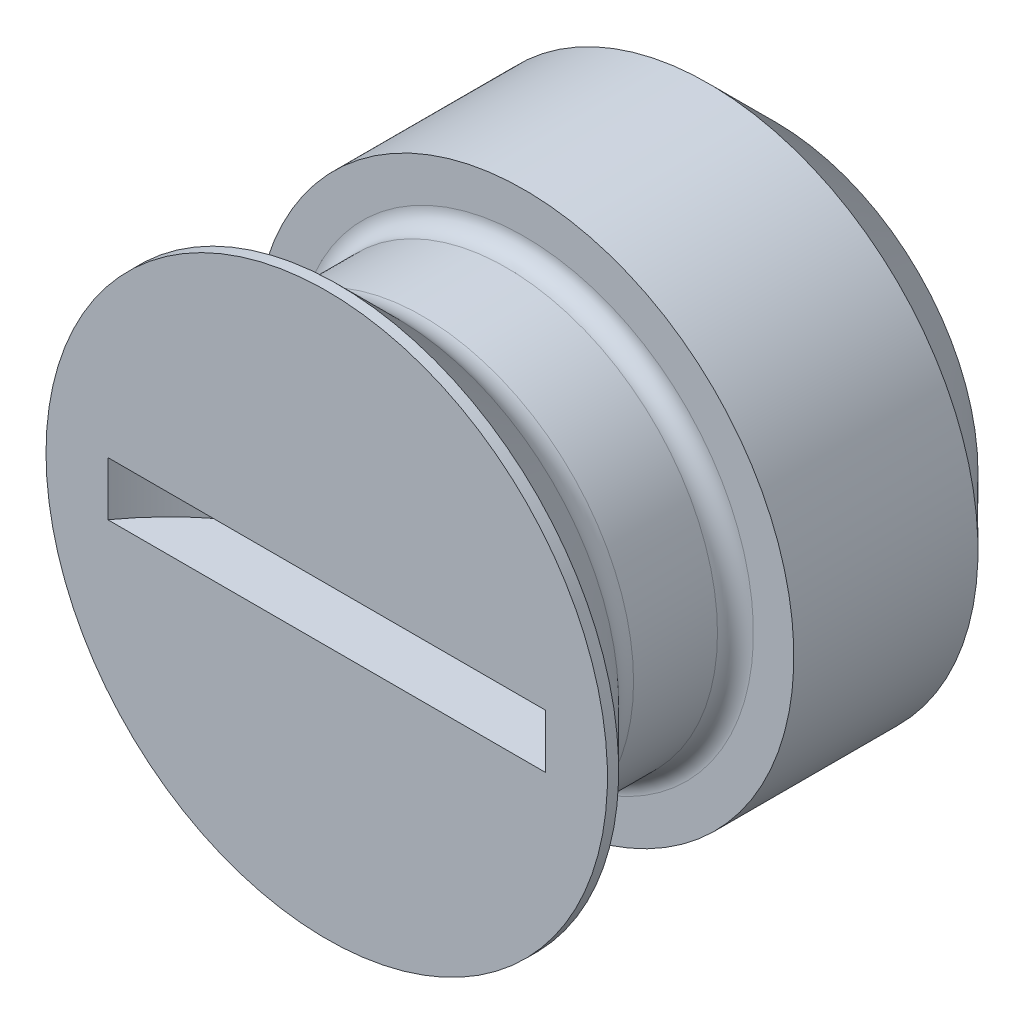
ISO-10303-21;
HEADER;
FILE_DESCRIPTION(('STEP AP214'),'2;1');
FILE_NAME('part.step','',(''),(''),'','','');
FILE_SCHEMA(('AUTOMOTIVE_DESIGN { 1 0 10303 214 1 1 1 1 }'));
ENDSEC;
DATA;
#1=APPLICATION_CONTEXT('core data for automotive mechanical design processes');
#2=APPLICATION_PROTOCOL_DEFINITION('international standard','automotive_design',2000,#1);
#3=PRODUCT_CONTEXT('',#1,'mechanical');
#4=PRODUCT('Part','Part','',(#3));
#5=PRODUCT_RELATED_PRODUCT_CATEGORY('part','',(#4));
#6=PRODUCT_DEFINITION_FORMATION('','',#4);
#7=PRODUCT_DEFINITION_CONTEXT('part definition',#1,'design');
#8=PRODUCT_DEFINITION('design','',#6,#7);
#9=PRODUCT_DEFINITION_SHAPE('','',#8);
#10=(LENGTH_UNIT() NAMED_UNIT(*) SI_UNIT(.MILLI.,.METRE.));
#11=(NAMED_UNIT(*) PLANE_ANGLE_UNIT() SI_UNIT($,.RADIAN.));
#12=(NAMED_UNIT(*) SI_UNIT($,.STERADIAN.) SOLID_ANGLE_UNIT());
#13=UNCERTAINTY_MEASURE_WITH_UNIT(LENGTH_MEASURE(1.E-05),#10,'distance_accuracy_value','');
#14=(GEOMETRIC_REPRESENTATION_CONTEXT(3) GLOBAL_UNCERTAINTY_ASSIGNED_CONTEXT((#13)) GLOBAL_UNIT_ASSIGNED_CONTEXT((#10,
#11,#12)) REPRESENTATION_CONTEXT('',''));
#15=CARTESIAN_POINT('',(0.,0.,0.));
#16=DIRECTION('',(0.,0.,1.));
#17=DIRECTION('',(1.,0.,0.));
#18=AXIS2_PLACEMENT_3D('',#15,#16,#17);
#19=CARTESIAN_POINT('',(0.,0.,0.));
#20=DIRECTION('',(0.,0.,-1.));
#21=DIRECTION('',(1.,0.,0.));
#22=AXIS2_PLACEMENT_3D('',#19,#20,#21);
#23=PLANE('',#22);
#24=DIRECTION('',(-1.,0.,0.));
#25=VECTOR('',#24,1.);
#26=CARTESIAN_POINT('',(4.87339717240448,0.6,0.));
#27=LINE('',#26,#25);
#28=CARTESIAN_POINT('',(4.87339717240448,0.6,0.));
#29=VERTEX_POINT('',#28);
#30=CARTESIAN_POINT('',(-4.87339717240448,0.6,0.));
#31=VERTEX_POINT('',#30);
#32=EDGE_CURVE('E48',#29,#31,#27,.T.);
#33=ORIENTED_EDGE('',*,*,#32,.F.);
#34=DIRECTION('',(0.,-1.,0.));
#35=VECTOR('',#34,1.);
#36=CARTESIAN_POINT('',(4.87339717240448,1.2,0.));
#37=LINE('',#36,#35);
#38=CARTESIAN_POINT('',(4.87339717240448,-0.6,0.));
#39=VERTEX_POINT('',#38);
#40=EDGE_CURVE('E9',#29,#39,#37,.T.);
#41=ORIENTED_EDGE('',*,*,#40,.T.);
#42=DIRECTION('',(1.,0.,0.));
#43=VECTOR('',#42,1.);
#44=CARTESIAN_POINT('',(-4.87339717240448,-0.6,0.));
#45=LINE('',#44,#43);
#46=CARTESIAN_POINT('',(-4.87339717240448,-0.6,0.));
#47=VERTEX_POINT('',#46);
#48=EDGE_CURVE('E47',#47,#39,#45,.T.);
#49=ORIENTED_EDGE('',*,*,#48,.F.);
#50=DIRECTION('',(0.,-1.,0.));
#51=VECTOR('',#50,1.);
#52=CARTESIAN_POINT('',(-4.87339717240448,1.2,0.));
#53=LINE('',#52,#51);
#54=EDGE_CURVE('E22',#47,#31,#53,.F.);
#55=ORIENTED_EDGE('',*,*,#54,.T.);
#56=EDGE_LOOP('',(#33,#41,#49,#55));
#57=FACE_BOUND('',#56,.T.);
#58=CARTESIAN_POINT('',(0.,0.,0.));
#59=DIRECTION('',(0.,0.,1.));
#60=DIRECTION('',(-1.,0.,0.));
#61=AXIS2_PLACEMENT_3D('',#58,#59,#60);
#62=CIRCLE('',#61,6.25000000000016);
#63=CARTESIAN_POINT('',(-6.25000000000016,0.,0.));
#64=VERTEX_POINT('',#63);
#65=EDGE_CURVE('E51',#64,#64,#62,.T.);
#66=ORIENTED_EDGE('',*,*,#65,.T.);
#67=EDGE_LOOP('',(#66));
#68=FACE_BOUND('',#67,.T.);
#69=ADVANCED_FACE('F14',(#57,#68),#23,.F.);
#70=CARTESIAN_POINT('',(0.,-4.49999999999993,-10.0000000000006));
#71=DIRECTION('',(0.,0.,1.));
#72=DIRECTION('',(-1.,0.,0.));
#73=AXIS2_PLACEMENT_3D('',#70,#71,#72);
#74=PLANE('',#73);
#75=CARTESIAN_POINT('',(0.,0.,-10.0000000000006));
#76=DIRECTION('',(0.,0.,1.));
#77=DIRECTION('',(-1.,0.,0.));
#78=AXIS2_PLACEMENT_3D('',#75,#76,#77);
#79=CIRCLE('',#78,4.49999999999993);
#80=CARTESIAN_POINT('',(-4.49999999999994,0.,-10.0000000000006));
#81=VERTEX_POINT('',#80);
#82=EDGE_CURVE('E44',#81,#81,#79,.T.);
#83=ORIENTED_EDGE('',*,*,#82,.F.);
#84=EDGE_LOOP('',(#83));
#85=FACE_BOUND('',#84,.T.);
#86=ADVANCED_FACE('F16',(#85),#74,.F.);
#87=CARTESIAN_POINT('',(0.,0.,-10.0000000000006));
#88=DIRECTION('',(0.,0.,1.));
#89=DIRECTION('',(-1.,0.,0.));
#90=AXIS2_PLACEMENT_3D('',#87,#88,#89);
#91=CONICAL_SURFACE('',#90,4.49999999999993,0.785398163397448);
#92=CARTESIAN_POINT('',(0.,0.,-8.5000000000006));
#93=DIRECTION('',(0.,0.,1.));
#94=DIRECTION('',(-1.,0.,0.));
#95=AXIS2_PLACEMENT_3D('',#92,#93,#94);
#96=CIRCLE('',#95,6.);
#97=CARTESIAN_POINT('',(-6.,0.,-8.5000000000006));
#98=VERTEX_POINT('',#97);
#99=EDGE_CURVE('E75',#98,#98,#96,.T.);
#100=ORIENTED_EDGE('',*,*,#99,.F.);
#101=EDGE_LOOP('',(#100));
#102=FACE_BOUND('',#101,.T.);
#103=ORIENTED_EDGE('',*,*,#82,.T.);
#104=EDGE_LOOP('',(#103));
#105=FACE_BOUND('',#104,.T.);
#106=ADVANCED_FACE('F81',(#102,#105),#91,.T.);
#107=CARTESIAN_POINT('',(0.,0.,0.));
#108=DIRECTION('',(0.,0.,1.));
#109=DIRECTION('',(-1.,0.,0.));
#110=AXIS2_PLACEMENT_3D('',#107,#108,#109);
#111=CYLINDRICAL_SURFACE('',#110,6.);
#112=CARTESIAN_POINT('',(0.,0.,-4.40000000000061));
#113=DIRECTION('',(0.,0.,1.));
#114=DIRECTION('',(-1.,0.,0.));
#115=AXIS2_PLACEMENT_3D('',#112,#113,#114);
#116=CIRCLE('',#115,6.);
#117=CARTESIAN_POINT('',(-6.,0.,-4.40000000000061));
#118=VERTEX_POINT('',#117);
#119=EDGE_CURVE('E72',#118,#118,#116,.T.);
#120=ORIENTED_EDGE('',*,*,#119,.F.);
#121=EDGE_LOOP('',(#120));
#122=FACE_BOUND('',#121,.T.);
#123=ORIENTED_EDGE('',*,*,#99,.T.);
#124=EDGE_LOOP('',(#123));
#125=FACE_BOUND('',#124,.T.);
#126=ADVANCED_FACE('F90',(#122,#125),#111,.T.);
#127=CARTESIAN_POINT('',(0.,-6.,-4.40000000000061));
#128=DIRECTION('',(0.,0.,-1.));
#129=DIRECTION('',(1.,0.,0.));
#130=AXIS2_PLACEMENT_3D('',#127,#128,#129);
#131=PLANE('',#130);
#132=CARTESIAN_POINT('',(0.,0.,-4.40000000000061));
#133=DIRECTION('',(0.,0.,1.));
#134=DIRECTION('',(-1.,0.,0.));
#135=AXIS2_PLACEMENT_3D('',#132,#133,#134);
#136=CIRCLE('',#135,5.1);
#137=CARTESIAN_POINT('',(-5.1,0.,-4.40000000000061));
#138=VERTEX_POINT('',#137);
#139=EDGE_CURVE('E69',#138,#138,#136,.T.);
#140=ORIENTED_EDGE('',*,*,#139,.F.);
#141=EDGE_LOOP('',(#140));
#142=FACE_BOUND('',#141,.T.);
#143=ORIENTED_EDGE('',*,*,#119,.T.);
#144=EDGE_LOOP('',(#143));
#145=FACE_BOUND('',#144,.T.);
#146=ADVANCED_FACE('F118',(#142,#145),#131,.F.);
#147=CARTESIAN_POINT('',(0.,0.,-4.00000000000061));
#148=DIRECTION('',(0.,0.,1.));
#149=DIRECTION('',(-1.,0.,0.));
#150=AXIS2_PLACEMENT_3D('',#147,#148,#149);
#151=TOROIDAL_SURFACE('',#150,5.1,0.4);
#152=CARTESIAN_POINT('',(0.,0.,-4.00000000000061));
#153=DIRECTION('',(0.,0.,1.));
#154=DIRECTION('',(-1.,0.,0.));
#155=AXIS2_PLACEMENT_3D('',#152,#153,#154);
#156=CIRCLE('',#155,4.7);
#157=CARTESIAN_POINT('',(-4.7,0.,-4.00000000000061));
#158=VERTEX_POINT('',#157);
#159=EDGE_CURVE('E66',#158,#158,#156,.T.);
#160=ORIENTED_EDGE('',*,*,#159,.F.);
#161=EDGE_LOOP('',(#160));
#162=FACE_BOUND('',#161,.T.);
#163=ORIENTED_EDGE('',*,*,#139,.T.);
#164=EDGE_LOOP('',(#163));
#165=FACE_BOUND('',#164,.T.);
#166=ADVANCED_FACE('F114',(#162,#165),#151,.F.);
#167=CARTESIAN_POINT('',(0.,0.,0.));
#168=DIRECTION('',(0.,0.,1.));
#169=DIRECTION('',(-1.,0.,0.));
#170=AXIS2_PLACEMENT_3D('',#167,#168,#169);
#171=CYLINDRICAL_SURFACE('',#170,4.7);
#172=CARTESIAN_POINT('',(0.,0.,-2.13137084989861));
#173=DIRECTION('',(0.,0.,1.));
#174=DIRECTION('',(-1.,0.,0.));
#175=AXIS2_PLACEMENT_3D('',#172,#173,#174);
#176=CIRCLE('',#175,4.7);
#177=CARTESIAN_POINT('',(-4.7,0.,-2.13137084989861));
#178=VERTEX_POINT('',#177);
#179=EDGE_CURVE('E63',#178,#178,#176,.T.);
#180=ORIENTED_EDGE('',*,*,#179,.F.);
#181=EDGE_LOOP('',(#180));
#182=FACE_BOUND('',#181,.T.);
#183=ORIENTED_EDGE('',*,*,#159,.T.);
#184=EDGE_LOOP('',(#183));
#185=FACE_BOUND('',#184,.T.);
#186=ADVANCED_FACE('F110',(#182,#185),#171,.T.);
#187=CARTESIAN_POINT('',(0.,0.,-2.13137084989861));
#188=DIRECTION('',(0.,0.,1.));
#189=DIRECTION('',(-1.,0.,0.));
#190=AXIS2_PLACEMENT_3D('',#187,#188,#189);
#191=TOROIDAL_SURFACE('',#190,5.5,0.8);
#192=CARTESIAN_POINT('',(0.,0.,-1.56568542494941));
#193=DIRECTION('',(0.,0.,1.));
#194=DIRECTION('',(-1.,0.,0.));
#195=AXIS2_PLACEMENT_3D('',#192,#193,#194);
#196=CIRCLE('',#195,4.93431457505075);
#197=CARTESIAN_POINT('',(-4.93431457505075,0.,-1.5656854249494));
#198=VERTEX_POINT('',#197);
#199=EDGE_CURVE('E60',#198,#198,#196,.T.);
#200=ORIENTED_EDGE('',*,*,#199,.F.);
#201=EDGE_LOOP('',(#200));
#202=FACE_BOUND('',#201,.T.);
#203=ORIENTED_EDGE('',*,*,#179,.T.);
#204=EDGE_LOOP('',(#203));
#205=FACE_BOUND('',#204,.T.);
#206=ADVANCED_FACE('F106',(#202,#205),#191,.F.);
#207=CARTESIAN_POINT('',(0.,0.,-1.56568542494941));
#208=DIRECTION('',(0.,0.,1.));
#209=DIRECTION('',(-1.,0.,0.));
#210=AXIS2_PLACEMENT_3D('',#207,#208,#209);
#211=CONICAL_SURFACE('',#210,4.93431457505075,0.785398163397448);
#212=CARTESIAN_POINT('',(0.,0.,-0.25));
#213=DIRECTION('',(0.,0.,1.));
#214=DIRECTION('',(-1.,0.,0.));
#215=AXIS2_PLACEMENT_3D('',#212,#213,#214);
#216=CIRCLE('',#215,6.25000000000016);
#217=CARTESIAN_POINT('',(-6.25000000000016,0.,-0.249999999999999));
#218=VERTEX_POINT('',#217);
#219=EDGE_CURVE('E54',#218,#218,#216,.T.);
#220=ORIENTED_EDGE('',*,*,#219,.F.);
#221=EDGE_LOOP('',(#220));
#222=FACE_BOUND('',#221,.T.);
#223=ORIENTED_EDGE('',*,*,#199,.T.);
#224=EDGE_LOOP('',(#223));
#225=FACE_BOUND('',#224,.T.);
#226=ADVANCED_FACE('F102',(#222,#225),#211,.T.);
#227=CARTESIAN_POINT('',(0.,0.,0.));
#228=DIRECTION('',(0.,0.,1.));
#229=DIRECTION('',(-1.,0.,0.));
#230=AXIS2_PLACEMENT_3D('',#227,#228,#229);
#231=CYLINDRICAL_SURFACE('',#230,6.25000000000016);
#232=ORIENTED_EDGE('',*,*,#65,.F.);
#233=EDGE_LOOP('',(#232));
#234=FACE_BOUND('',#233,.T.);
#235=ORIENTED_EDGE('',*,*,#219,.T.);
#236=EDGE_LOOP('',(#235));
#237=FACE_BOUND('',#236,.T.);
#238=ADVANCED_FACE('F99',(#234,#237),#231,.T.);
#239=CARTESIAN_POINT('',(0.,1.2,3.5));
#240=DIRECTION('',(0.,-1.,0.));
#241=DIRECTION('',(-1.,0.,0.));
#242=AXIS2_PLACEMENT_3D('',#239,#240,#241);
#243=CYLINDRICAL_SURFACE('',#242,6.);
#244=ORIENTED_EDGE('',*,*,#40,.F.);
#245=CARTESIAN_POINT('',(0.,0.6,3.5));
#246=DIRECTION('',(0.,-1.,0.));
#247=DIRECTION('',(-1.,0.,0.));
#248=AXIS2_PLACEMENT_3D('',#245,#246,#247);
#249=CIRCLE('',#248,6.);
#250=EDGE_CURVE('E32',#31,#29,#249,.T.);
#251=ORIENTED_EDGE('',*,*,#250,.F.);
#252=ORIENTED_EDGE('',*,*,#54,.F.);
#253=CARTESIAN_POINT('',(0.,-0.6,3.5));
#254=DIRECTION('',(0.,1.,0.));
#255=DIRECTION('',(1.,0.,0.));
#256=AXIS2_PLACEMENT_3D('',#253,#254,#255);
#257=CIRCLE('',#256,6.);
#258=EDGE_CURVE('E39',#39,#47,#257,.T.);
#259=ORIENTED_EDGE('',*,*,#258,.F.);
#260=EDGE_LOOP('',(#244,#251,#252,#259));
#261=FACE_BOUND('',#260,.T.);
#262=ADVANCED_FACE('F38',(#261),#243,.F.);
#263=CARTESIAN_POINT('',(0.,-0.6,3.5));
#264=DIRECTION('',(0.,1.,0.));
#265=DIRECTION('',(1.,0.,0.));
#266=AXIS2_PLACEMENT_3D('',#263,#264,#265);
#267=PLANE('',#266);
#268=ORIENTED_EDGE('',*,*,#258,.T.);
#269=ORIENTED_EDGE('',*,*,#48,.T.);
#270=EDGE_LOOP('',(#268,#269));
#271=FACE_BOUND('',#270,.T.);
#272=ADVANCED_FACE('F46',(#271),#267,.T.);
#273=CARTESIAN_POINT('',(0.,0.6,3.5));
#274=DIRECTION('',(0.,-1.,0.));
#275=DIRECTION('',(-1.,0.,0.));
#276=AXIS2_PLACEMENT_3D('',#273,#274,#275);
#277=PLANE('',#276);
#278=ORIENTED_EDGE('',*,*,#250,.T.);
#279=ORIENTED_EDGE('',*,*,#32,.T.);
#280=EDGE_LOOP('',(#278,#279));
#281=FACE_BOUND('',#280,.T.);
#282=ADVANCED_FACE('F181',(#281),#277,.T.);
#283=CLOSED_SHELL('',(#69,#86,#106,#126,#146,#166,#186,#206,#226,#238,#262,#272,#282));
#284=MANIFOLD_SOLID_BREP('B1',#283);
#285=ADVANCED_BREP_SHAPE_REPRESENTATION('',(#18,#284),#14);
#286=SHAPE_DEFINITION_REPRESENTATION(#9,#285);
ENDSEC;
END-ISO-10303-21;
